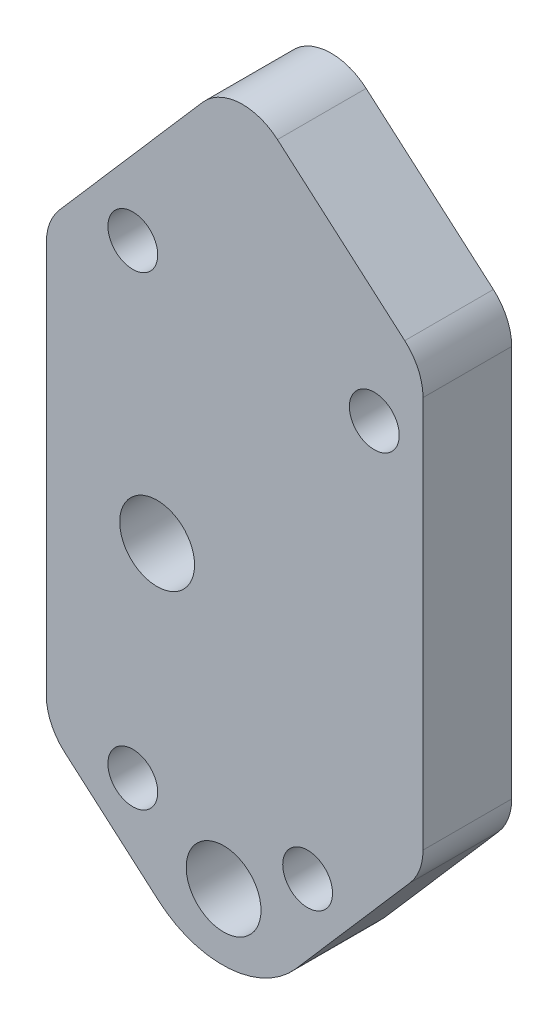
from build123d import *

# Parameters (mm, degrees)
BOSS_EXTRUDE1_DEPTH = 12.7
HOLE13_D            = 7.1374
HOLE14_D            = 7.1374
HOLE14_CBORE_D      = 10.7188
HOLE14_CBORE_DEPTH  = 7.874


with BuildPart() as part:
    # Sketch1 → Boss-Extrude1 (new body)
    with BuildSketch(Plane(origin=(0, 0, 71.9582), x_dir=(-1, 0, 0), z_dir=(0, 0, -1))):
        with BuildLine():
            Line((777.70967063, -55.74984868), (794.049288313, -74.564991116))
            ThreePointArc((794.049288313, -74.564991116), (803.615750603, -79.340491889), (813.75704994, -75.952770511))
            Line((813.75704994, -75.952770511), (827.194358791, -64.283420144))
            ThreePointArc((827.194358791, -64.283420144), (829.131132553, -61.691747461), (829.818, -58.530090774))
            Line((829.818, -58.530090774), (829.818, -2.38626948))
            ThreePointArc((829.818, -2.38626948), (829.336093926, 0.28056668), (827.95132937, 2.610089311))
            Line((827.95132937, 2.610089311), (807.448079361, 26.219672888))
            ThreePointArc((807.448079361, 26.219672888), (802.230009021, 28.824491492), (796.698391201, 26.976643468))
            Line((796.698391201, 26.976643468), (778.466641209, 11.143660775))
            ThreePointArc((778.466641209, 11.143660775), (776.529867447, 8.551988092), (775.843, 5.390331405))
            Line((775.843, 5.390331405), (775.843, -50.753489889))
            ThreePointArc((775.843, -50.753489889), (776.324906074, -53.420326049), (777.70967063, -55.74984868))
        make_face()
    extrude(amount=-BOSS_EXTRUDE1_DEPTH)

    # Hole13 (through all)
    with Locations(Plane(origin=(-780.443739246, 10.042884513, 71.9582), x_dir=(-1, 0, 0), z_dir=(0, 0, -1))):
        with Locations((2.384260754, -11.044570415), (36.981254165, -5.964570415), (11.934422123, -72.639570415), (36.981254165, -72.639570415)):
            Hole(HOLE13_D / 2)

    # Hole14 (through all)
    with Locations(Plane(origin=(-817.287107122, -68.911392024, 84.6582), x_dir=(1, 0, 0), z_dir=(0, 0, 1))):
        with Locations((12.869107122, -0.934999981), (3.344107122, 37.161392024)):
            CounterBoreHole(HOLE14_D / 2, HOLE14_CBORE_D / 2, HOLE14_CBORE_DEPTH)


solid = part.part
